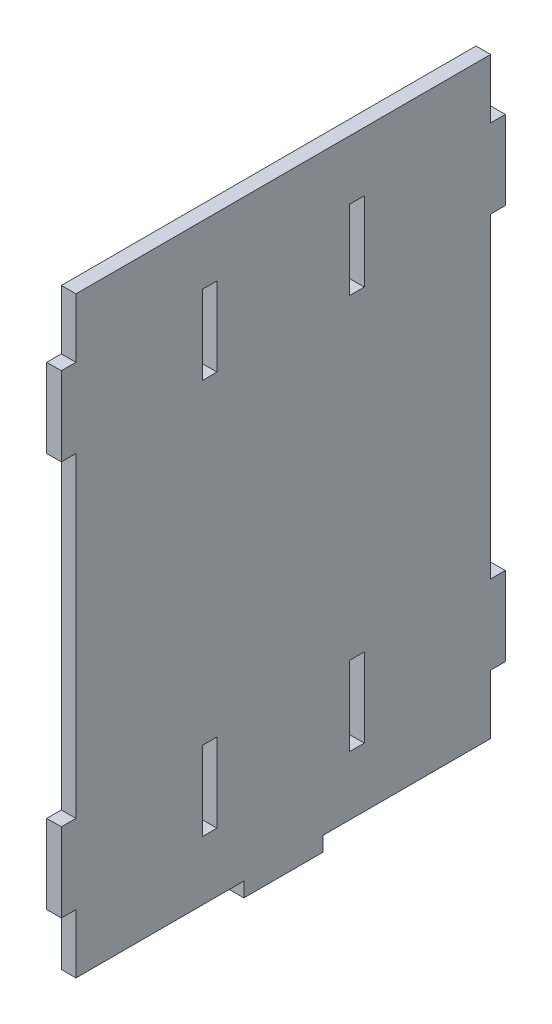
ISO-10303-21;
HEADER;
FILE_DESCRIPTION(('STEP AP214'),'2;1');
FILE_NAME('part.step','',(''),(''),'','','');
FILE_SCHEMA(('AUTOMOTIVE_DESIGN { 1 0 10303 214 1 1 1 1 }'));
ENDSEC;
DATA;
#1=APPLICATION_CONTEXT('core data for automotive mechanical design processes');
#2=APPLICATION_PROTOCOL_DEFINITION('international standard','automotive_design',2000,#1);
#3=PRODUCT_CONTEXT('',#1,'mechanical');
#4=PRODUCT('Part','Part','',(#3));
#5=PRODUCT_RELATED_PRODUCT_CATEGORY('part','',(#4));
#6=PRODUCT_DEFINITION_FORMATION('','',#4);
#7=PRODUCT_DEFINITION_CONTEXT('part definition',#1,'design');
#8=PRODUCT_DEFINITION('design','',#6,#7);
#9=PRODUCT_DEFINITION_SHAPE('','',#8);
#10=(LENGTH_UNIT() NAMED_UNIT(*) SI_UNIT(.MILLI.,.METRE.));
#11=(NAMED_UNIT(*) PLANE_ANGLE_UNIT() SI_UNIT($,.RADIAN.));
#12=(NAMED_UNIT(*) SI_UNIT($,.STERADIAN.) SOLID_ANGLE_UNIT());
#13=UNCERTAINTY_MEASURE_WITH_UNIT(LENGTH_MEASURE(1.E-05),#10,'distance_accuracy_value','');
#14=(GEOMETRIC_REPRESENTATION_CONTEXT(3) GLOBAL_UNCERTAINTY_ASSIGNED_CONTEXT((#13)) GLOBAL_UNIT_ASSIGNED_CONTEXT((#10,
#11,#12)) REPRESENTATION_CONTEXT('',''));
#15=CARTESIAN_POINT('',(0.,0.,0.));
#16=DIRECTION('',(0.,0.,1.));
#17=DIRECTION('',(1.,0.,0.));
#18=AXIS2_PLACEMENT_3D('',#15,#16,#17);
#19=CARTESIAN_POINT('',(3.7,0.,52.5));
#20=DIRECTION('',(-1.,0.,0.));
#21=DIRECTION('',(0.,0.,1.));
#22=AXIS2_PLACEMENT_3D('',#19,#20,#21);
#23=PLANE('',#22);
#24=DIRECTION('',(0.,-1.,0.));
#25=VECTOR('',#24,1.);
#26=CARTESIAN_POINT('',(3.7,35.,20.5));
#27=LINE('',#26,#25);
#28=CARTESIAN_POINT('',(3.7,35.,20.5));
#29=VERTEX_POINT('',#28);
#30=CARTESIAN_POINT('',(3.7,15.,20.5));
#31=VERTEX_POINT('',#30);
#32=EDGE_CURVE('E425',#29,#31,#27,.T.);
#33=ORIENTED_EDGE('',*,*,#32,.F.);
#34=DIRECTION('',(0.,0.,1.));
#35=VECTOR('',#34,1.);
#36=CARTESIAN_POINT('',(3.7,35.,20.5));
#37=LINE('',#36,#35);
#38=CARTESIAN_POINT('',(3.7,35.,16.8));
#39=VERTEX_POINT('',#38);
#40=EDGE_CURVE('E436',#39,#29,#37,.T.);
#41=ORIENTED_EDGE('',*,*,#40,.F.);
#42=DIRECTION('',(0.,1.,0.));
#43=VECTOR('',#42,1.);
#44=CARTESIAN_POINT('',(3.7,35.,16.8));
#45=LINE('',#44,#43);
#46=CARTESIAN_POINT('',(3.7,15.,16.8));
#47=VERTEX_POINT('',#46);
#48=EDGE_CURVE('E432',#47,#39,#45,.T.);
#49=ORIENTED_EDGE('',*,*,#48,.F.);
#50=DIRECTION('',(0.,0.,-1.));
#51=VECTOR('',#50,1.);
#52=CARTESIAN_POINT('',(3.7,15.,20.5));
#53=LINE('',#52,#51);
#54=EDGE_CURVE('E428',#31,#47,#53,.T.);
#55=ORIENTED_EDGE('',*,*,#54,.F.);
#56=EDGE_LOOP('',(#33,#41,#49,#55));
#57=FACE_BOUND('',#56,.T.);
#58=DIRECTION('',(0.,-1.,0.));
#59=VECTOR('',#58,1.);
#60=CARTESIAN_POINT('',(3.7,135.,20.5));
#61=LINE('',#60,#59);
#62=CARTESIAN_POINT('',(3.7,135.,20.5));
#63=VERTEX_POINT('',#62);
#64=CARTESIAN_POINT('',(3.7,115.,20.5));
#65=VERTEX_POINT('',#64);
#66=EDGE_CURVE('E510',#63,#65,#61,.T.);
#67=ORIENTED_EDGE('',*,*,#66,.F.);
#68=DIRECTION('',(0.,0.,1.));
#69=VECTOR('',#68,1.);
#70=CARTESIAN_POINT('',(3.7,135.,20.5));
#71=LINE('',#70,#69);
#72=CARTESIAN_POINT('',(3.7,135.,16.8));
#73=VERTEX_POINT('',#72);
#74=EDGE_CURVE('E521',#73,#63,#71,.T.);
#75=ORIENTED_EDGE('',*,*,#74,.F.);
#76=DIRECTION('',(0.,1.,0.));
#77=VECTOR('',#76,1.);
#78=CARTESIAN_POINT('',(3.7,135.,16.8));
#79=LINE('',#78,#77);
#80=CARTESIAN_POINT('',(3.7,115.,16.8));
#81=VERTEX_POINT('',#80);
#82=EDGE_CURVE('E517',#81,#73,#79,.T.);
#83=ORIENTED_EDGE('',*,*,#82,.F.);
#84=DIRECTION('',(0.,0.,-1.));
#85=VECTOR('',#84,1.);
#86=CARTESIAN_POINT('',(3.7,115.,20.5));
#87=LINE('',#86,#85);
#88=EDGE_CURVE('E513',#65,#81,#87,.T.);
#89=ORIENTED_EDGE('',*,*,#88,.F.);
#90=EDGE_LOOP('',(#67,#75,#83,#89));
#91=FACE_BOUND('',#90,.T.);
#92=DIRECTION('',(0.,0.,-1.));
#93=VECTOR('',#92,1.);
#94=CARTESIAN_POINT('',(3.7,0.,10.));
#95=LINE('',#94,#93);
#96=CARTESIAN_POINT('',(3.7,0.,52.5));
#97=VERTEX_POINT('',#96);
#98=CARTESIAN_POINT('',(3.7,0.,10.));
#99=VERTEX_POINT('',#98);
#100=EDGE_CURVE('E553',#97,#99,#95,.T.);
#101=ORIENTED_EDGE('',*,*,#100,.T.);
#102=DIRECTION('',(0.,-1.,0.));
#103=VECTOR('',#102,1.);
#104=CARTESIAN_POINT('',(3.7,0.,10.));
#105=LINE('',#104,#103);
#106=CARTESIAN_POINT('',(3.7,-3.7,10.));
#107=VERTEX_POINT('',#106);
#108=EDGE_CURVE('E557',#99,#107,#105,.T.);
#109=ORIENTED_EDGE('',*,*,#108,.T.);
#110=DIRECTION('',(0.,0.,-1.));
#111=VECTOR('',#110,1.);
#112=CARTESIAN_POINT('',(3.7,-3.7,10.));
#113=LINE('',#112,#111);
#114=CARTESIAN_POINT('',(3.7,-3.7,-10.));
#115=VERTEX_POINT('',#114);
#116=EDGE_CURVE('E561',#107,#115,#113,.T.);
#117=ORIENTED_EDGE('',*,*,#116,.T.);
#118=DIRECTION('',(0.,1.,0.));
#119=VECTOR('',#118,1.);
#120=CARTESIAN_POINT('',(3.7,0.,-10.));
#121=LINE('',#120,#119);
#122=CARTESIAN_POINT('',(3.7,0.,-10.));
#123=VERTEX_POINT('',#122);
#124=EDGE_CURVE('E564',#115,#123,#121,.T.);
#125=ORIENTED_EDGE('',*,*,#124,.T.);
#126=DIRECTION('',(0.,0.,-1.));
#127=VECTOR('',#126,1.);
#128=CARTESIAN_POINT('',(3.7,0.,-10.));
#129=LINE('',#128,#127);
#130=CARTESIAN_POINT('',(3.7,0.,-52.5));
#131=VERTEX_POINT('',#130);
#132=EDGE_CURVE('E567',#123,#131,#129,.T.);
#133=ORIENTED_EDGE('',*,*,#132,.T.);
#134=DIRECTION('',(0.,1.,0.));
#135=VECTOR('',#134,1.);
#136=CARTESIAN_POINT('',(3.7,0.,-52.5));
#137=LINE('',#136,#135);
#138=CARTESIAN_POINT('',(3.7,15.,-52.5));
#139=VERTEX_POINT('',#138);
#140=EDGE_CURVE('E570',#131,#139,#137,.T.);
#141=ORIENTED_EDGE('',*,*,#140,.T.);
#142=DIRECTION('',(0.,0.,-1.));
#143=VECTOR('',#142,1.);
#144=CARTESIAN_POINT('',(3.7,15.,-52.5));
#145=LINE('',#144,#143);
#146=CARTESIAN_POINT('',(3.7,15.,-56.2));
#147=VERTEX_POINT('',#146);
#148=EDGE_CURVE('E573',#139,#147,#145,.T.);
#149=ORIENTED_EDGE('',*,*,#148,.T.);
#150=DIRECTION('',(0.,1.,0.));
#151=VECTOR('',#150,1.);
#152=CARTESIAN_POINT('',(3.7,35.,-56.2));
#153=LINE('',#152,#151);
#154=CARTESIAN_POINT('',(3.7,35.,-56.2));
#155=VERTEX_POINT('',#154);
#156=EDGE_CURVE('E576',#147,#155,#153,.T.);
#157=ORIENTED_EDGE('',*,*,#156,.T.);
#158=DIRECTION('',(0.,0.,1.));
#159=VECTOR('',#158,1.);
#160=CARTESIAN_POINT('',(3.7,35.,-52.5));
#161=LINE('',#160,#159);
#162=CARTESIAN_POINT('',(3.7,35.,-52.5));
#163=VERTEX_POINT('',#162);
#164=EDGE_CURVE('E579',#155,#163,#161,.T.);
#165=ORIENTED_EDGE('',*,*,#164,.T.);
#166=DIRECTION('',(0.,1.,0.));
#167=VECTOR('',#166,1.);
#168=CARTESIAN_POINT('',(3.7,35.,-52.5));
#169=LINE('',#168,#167);
#170=CARTESIAN_POINT('',(3.7,115.,-52.5));
#171=VERTEX_POINT('',#170);
#172=EDGE_CURVE('E582',#163,#171,#169,.T.);
#173=ORIENTED_EDGE('',*,*,#172,.T.);
#174=DIRECTION('',(0.,0.,-1.));
#175=VECTOR('',#174,1.);
#176=CARTESIAN_POINT('',(3.7,115.,-52.5));
#177=LINE('',#176,#175);
#178=CARTESIAN_POINT('',(3.7,115.,-56.2));
#179=VERTEX_POINT('',#178);
#180=EDGE_CURVE('E585',#171,#179,#177,.T.);
#181=ORIENTED_EDGE('',*,*,#180,.T.);
#182=DIRECTION('',(0.,1.,0.));
#183=VECTOR('',#182,1.);
#184=CARTESIAN_POINT('',(3.7,135.,-56.2));
#185=LINE('',#184,#183);
#186=CARTESIAN_POINT('',(3.7,135.,-56.2));
#187=VERTEX_POINT('',#186);
#188=EDGE_CURVE('E588',#179,#187,#185,.T.);
#189=ORIENTED_EDGE('',*,*,#188,.T.);
#190=DIRECTION('',(0.,0.,1.));
#191=VECTOR('',#190,1.);
#192=CARTESIAN_POINT('',(3.7,135.,-52.5));
#193=LINE('',#192,#191);
#194=CARTESIAN_POINT('',(3.7,135.,-52.5));
#195=VERTEX_POINT('',#194);
#196=EDGE_CURVE('E591',#187,#195,#193,.T.);
#197=ORIENTED_EDGE('',*,*,#196,.T.);
#198=DIRECTION('',(0.,1.,0.));
#199=VECTOR('',#198,1.);
#200=CARTESIAN_POINT('',(3.7,135.,-52.5));
#201=LINE('',#200,#199);
#202=CARTESIAN_POINT('',(3.7,150.,-52.5));
#203=VERTEX_POINT('',#202);
#204=EDGE_CURVE('E594',#195,#203,#201,.T.);
#205=ORIENTED_EDGE('',*,*,#204,.T.);
#206=DIRECTION('',(0.,0.,1.));
#207=VECTOR('',#206,1.);
#208=CARTESIAN_POINT('',(3.7,150.,52.5));
#209=LINE('',#208,#207);
#210=CARTESIAN_POINT('',(3.7,150.,52.5));
#211=VERTEX_POINT('',#210);
#212=EDGE_CURVE('E597',#203,#211,#209,.T.);
#213=ORIENTED_EDGE('',*,*,#212,.T.);
#214=DIRECTION('',(0.,-1.,0.));
#215=VECTOR('',#214,1.);
#216=CARTESIAN_POINT('',(3.7,135.,52.5));
#217=LINE('',#216,#215);
#218=CARTESIAN_POINT('',(3.7,135.,52.5));
#219=VERTEX_POINT('',#218);
#220=EDGE_CURVE('E600',#211,#219,#217,.T.);
#221=ORIENTED_EDGE('',*,*,#220,.T.);
#222=DIRECTION('',(0.,0.,1.));
#223=VECTOR('',#222,1.);
#224=CARTESIAN_POINT('',(3.7,135.,56.2));
#225=LINE('',#224,#223);
#226=CARTESIAN_POINT('',(3.7,135.,56.2));
#227=VERTEX_POINT('',#226);
#228=EDGE_CURVE('E603',#219,#227,#225,.T.);
#229=ORIENTED_EDGE('',*,*,#228,.T.);
#230=DIRECTION('',(0.,-1.,0.));
#231=VECTOR('',#230,1.);
#232=CARTESIAN_POINT('',(3.7,135.,56.2));
#233=LINE('',#232,#231);
#234=CARTESIAN_POINT('',(3.7,115.,56.2));
#235=VERTEX_POINT('',#234);
#236=EDGE_CURVE('E606',#227,#235,#233,.T.);
#237=ORIENTED_EDGE('',*,*,#236,.T.);
#238=DIRECTION('',(0.,0.,-1.));
#239=VECTOR('',#238,1.);
#240=CARTESIAN_POINT('',(3.7,115.,56.2));
#241=LINE('',#240,#239);
#242=CARTESIAN_POINT('',(3.7,115.,52.5));
#243=VERTEX_POINT('',#242);
#244=EDGE_CURVE('E609',#235,#243,#241,.T.);
#245=ORIENTED_EDGE('',*,*,#244,.T.);
#246=DIRECTION('',(0.,-1.,0.));
#247=VECTOR('',#246,1.);
#248=CARTESIAN_POINT('',(3.7,35.,52.5));
#249=LINE('',#248,#247);
#250=CARTESIAN_POINT('',(3.7,35.,52.5));
#251=VERTEX_POINT('',#250);
#252=EDGE_CURVE('E612',#243,#251,#249,.T.);
#253=ORIENTED_EDGE('',*,*,#252,.T.);
#254=DIRECTION('',(0.,0.,1.));
#255=VECTOR('',#254,1.);
#256=CARTESIAN_POINT('',(3.7,35.,56.2));
#257=LINE('',#256,#255);
#258=CARTESIAN_POINT('',(3.7,35.,56.2));
#259=VERTEX_POINT('',#258);
#260=EDGE_CURVE('E615',#251,#259,#257,.T.);
#261=ORIENTED_EDGE('',*,*,#260,.T.);
#262=DIRECTION('',(0.,-1.,0.));
#263=VECTOR('',#262,1.);
#264=CARTESIAN_POINT('',(3.7,35.,56.2));
#265=LINE('',#264,#263);
#266=CARTESIAN_POINT('',(3.7,15.,56.2));
#267=VERTEX_POINT('',#266);
#268=EDGE_CURVE('E618',#259,#267,#265,.T.);
#269=ORIENTED_EDGE('',*,*,#268,.T.);
#270=DIRECTION('',(0.,0.,-1.));
#271=VECTOR('',#270,1.);
#272=CARTESIAN_POINT('',(3.7,15.,56.2));
#273=LINE('',#272,#271);
#274=CARTESIAN_POINT('',(3.7,15.,52.5));
#275=VERTEX_POINT('',#274);
#276=EDGE_CURVE('E621',#267,#275,#273,.T.);
#277=ORIENTED_EDGE('',*,*,#276,.T.);
#278=DIRECTION('',(0.,-1.,0.));
#279=VECTOR('',#278,1.);
#280=CARTESIAN_POINT('',(3.7,0.,52.5));
#281=LINE('',#280,#279);
#282=EDGE_CURVE('E624',#275,#97,#281,.T.);
#283=ORIENTED_EDGE('',*,*,#282,.T.);
#284=EDGE_LOOP('',(#101,#109,#117,#125,#133,#141,#149,#157,#165,#173,#181,#189,#197,#205,#213,
#221,#229,#237,#245,#253,#261,#269,#277,#283));
#285=FACE_BOUND('',#284,.T.);
#286=DIRECTION('',(0.,1.,0.));
#287=VECTOR('',#286,1.);
#288=CARTESIAN_POINT('',(3.7,135.,-20.5));
#289=LINE('',#288,#287);
#290=CARTESIAN_POINT('',(3.7,115.,-20.5));
#291=VERTEX_POINT('',#290);
#292=CARTESIAN_POINT('',(3.7,135.,-20.5));
#293=VERTEX_POINT('',#292);
#294=EDGE_CURVE('E468',#291,#293,#289,.T.);
#295=ORIENTED_EDGE('',*,*,#294,.F.);
#296=DIRECTION('',(0.,0.,-1.));
#297=VECTOR('',#296,1.);
#298=CARTESIAN_POINT('',(3.7,115.,-20.5));
#299=LINE('',#298,#297);
#300=CARTESIAN_POINT('',(3.7,115.,-16.8));
#301=VERTEX_POINT('',#300);
#302=EDGE_CURVE('E478',#301,#291,#299,.T.);
#303=ORIENTED_EDGE('',*,*,#302,.F.);
#304=DIRECTION('',(0.,-1.,0.));
#305=VECTOR('',#304,1.);
#306=CARTESIAN_POINT('',(3.7,135.,-16.8));
#307=LINE('',#306,#305);
#308=CARTESIAN_POINT('',(3.7,135.,-16.8));
#309=VERTEX_POINT('',#308);
#310=EDGE_CURVE('E474',#309,#301,#307,.T.);
#311=ORIENTED_EDGE('',*,*,#310,.F.);
#312=DIRECTION('',(0.,0.,1.));
#313=VECTOR('',#312,1.);
#314=CARTESIAN_POINT('',(3.7,135.,-20.5));
#315=LINE('',#314,#313);
#316=EDGE_CURVE('E470',#293,#309,#315,.T.);
#317=ORIENTED_EDGE('',*,*,#316,.F.);
#318=EDGE_LOOP('',(#295,#303,#311,#317));
#319=FACE_BOUND('',#318,.T.);
#320=DIRECTION('',(0.,-1.,0.));
#321=VECTOR('',#320,1.);
#322=CARTESIAN_POINT('',(3.7,35.,-16.8));
#323=LINE('',#322,#321);
#324=CARTESIAN_POINT('',(3.7,35.,-16.8));
#325=VERTEX_POINT('',#324);
#326=CARTESIAN_POINT('',(3.7,15.,-16.8));
#327=VERTEX_POINT('',#326);
#328=EDGE_CURVE('E376',#325,#327,#323,.T.);
#329=ORIENTED_EDGE('',*,*,#328,.F.);
#330=DIRECTION('',(0.,0.,1.));
#331=VECTOR('',#330,1.);
#332=CARTESIAN_POINT('',(3.7,35.,-16.8));
#333=LINE('',#332,#331);
#334=CARTESIAN_POINT('',(3.7,35.,-20.5));
#335=VERTEX_POINT('',#334);
#336=EDGE_CURVE('E403',#335,#325,#333,.T.);
#337=ORIENTED_EDGE('',*,*,#336,.F.);
#338=DIRECTION('',(0.,1.,0.));
#339=VECTOR('',#338,1.);
#340=CARTESIAN_POINT('',(3.7,35.,-20.5));
#341=LINE('',#340,#339);
#342=CARTESIAN_POINT('',(3.7,15.,-20.5));
#343=VERTEX_POINT('',#342);
#344=EDGE_CURVE('E398',#343,#335,#341,.T.);
#345=ORIENTED_EDGE('',*,*,#344,.F.);
#346=DIRECTION('',(0.,0.,-1.));
#347=VECTOR('',#346,1.);
#348=CARTESIAN_POINT('',(3.7,15.,-16.8));
#349=LINE('',#348,#347);
#350=EDGE_CURVE('E385',#327,#343,#349,.T.);
#351=ORIENTED_EDGE('',*,*,#350,.F.);
#352=EDGE_LOOP('',(#329,#337,#345,#351));
#353=FACE_BOUND('',#352,.T.);
#354=ADVANCED_FACE('F39',(#57,#91,#285,#319,#353),#23,.F.);
#355=CARTESIAN_POINT('',(0.,0.,52.5));
#356=DIRECTION('',(-1.,0.,0.));
#357=DIRECTION('',(0.,0.,1.));
#358=AXIS2_PLACEMENT_3D('',#355,#356,#357);
#359=PLANE('',#358);
#360=DIRECTION('',(0.,0.,1.));
#361=VECTOR('',#360,1.);
#362=CARTESIAN_POINT('',(0.,35.,20.5));
#363=LINE('',#362,#361);
#364=CARTESIAN_POINT('',(0.,35.,16.8));
#365=VERTEX_POINT('',#364);
#366=CARTESIAN_POINT('',(0.,35.,20.5));
#367=VERTEX_POINT('',#366);
#368=EDGE_CURVE('E429',#365,#367,#363,.T.);
#369=ORIENTED_EDGE('',*,*,#368,.T.);
#370=DIRECTION('',(0.,-1.,0.));
#371=VECTOR('',#370,1.);
#372=CARTESIAN_POINT('',(0.,35.,20.5));
#373=LINE('',#372,#371);
#374=CARTESIAN_POINT('',(0.,15.,20.5));
#375=VERTEX_POINT('',#374);
#376=EDGE_CURVE('E394',#367,#375,#373,.T.);
#377=ORIENTED_EDGE('',*,*,#376,.T.);
#378=DIRECTION('',(0.,0.,-1.));
#379=VECTOR('',#378,1.);
#380=CARTESIAN_POINT('',(0.,15.,20.5));
#381=LINE('',#380,#379);
#382=CARTESIAN_POINT('',(0.,15.,16.8));
#383=VERTEX_POINT('',#382);
#384=EDGE_CURVE('E443',#375,#383,#381,.T.);
#385=ORIENTED_EDGE('',*,*,#384,.T.);
#386=DIRECTION('',(0.,1.,0.));
#387=VECTOR('',#386,1.);
#388=CARTESIAN_POINT('',(0.,35.,16.8));
#389=LINE('',#388,#387);
#390=EDGE_CURVE('E447',#383,#365,#389,.T.);
#391=ORIENTED_EDGE('',*,*,#390,.T.);
#392=EDGE_LOOP('',(#369,#377,#385,#391));
#393=FACE_BOUND('',#392,.T.);
#394=DIRECTION('',(0.,0.,1.));
#395=VECTOR('',#394,1.);
#396=CARTESIAN_POINT('',(0.,135.,20.5));
#397=LINE('',#396,#395);
#398=CARTESIAN_POINT('',(0.,135.,16.8));
#399=VERTEX_POINT('',#398);
#400=CARTESIAN_POINT('',(0.,135.,20.5));
#401=VERTEX_POINT('',#400);
#402=EDGE_CURVE('E514',#399,#401,#397,.T.);
#403=ORIENTED_EDGE('',*,*,#402,.T.);
#404=DIRECTION('',(0.,-1.,0.));
#405=VECTOR('',#404,1.);
#406=CARTESIAN_POINT('',(0.,135.,20.5));
#407=LINE('',#406,#405);
#408=CARTESIAN_POINT('',(0.,115.,20.5));
#409=VERTEX_POINT('',#408);
#410=EDGE_CURVE('E509',#401,#409,#407,.T.);
#411=ORIENTED_EDGE('',*,*,#410,.T.);
#412=DIRECTION('',(0.,0.,-1.));
#413=VECTOR('',#412,1.);
#414=CARTESIAN_POINT('',(0.,115.,20.5));
#415=LINE('',#414,#413);
#416=CARTESIAN_POINT('',(0.,115.,16.8));
#417=VERTEX_POINT('',#416);
#418=EDGE_CURVE('E528',#409,#417,#415,.T.);
#419=ORIENTED_EDGE('',*,*,#418,.T.);
#420=DIRECTION('',(0.,1.,0.));
#421=VECTOR('',#420,1.);
#422=CARTESIAN_POINT('',(0.,135.,16.8));
#423=LINE('',#422,#421);
#424=EDGE_CURVE('E532',#417,#399,#423,.T.);
#425=ORIENTED_EDGE('',*,*,#424,.T.);
#426=EDGE_LOOP('',(#403,#411,#419,#425));
#427=FACE_BOUND('',#426,.T.);
#428=DIRECTION('',(0.,0.,-1.));
#429=VECTOR('',#428,1.);
#430=CARTESIAN_POINT('',(0.,0.,10.));
#431=LINE('',#430,#429);
#432=CARTESIAN_POINT('',(0.,0.,52.5));
#433=VERTEX_POINT('',#432);
#434=CARTESIAN_POINT('',(0.,0.,10.));
#435=VERTEX_POINT('',#434);
#436=EDGE_CURVE('E552',#433,#435,#431,.T.);
#437=ORIENTED_EDGE('',*,*,#436,.F.);
#438=DIRECTION('',(0.,-1.,0.));
#439=VECTOR('',#438,1.);
#440=CARTESIAN_POINT('',(0.,0.,52.5));
#441=LINE('',#440,#439);
#442=CARTESIAN_POINT('',(0.,15.,52.5));
#443=VERTEX_POINT('',#442);
#444=EDGE_CURVE('E558',#443,#433,#441,.T.);
#445=ORIENTED_EDGE('',*,*,#444,.F.);
#446=DIRECTION('',(0.,0.,-1.));
#447=VECTOR('',#446,1.);
#448=CARTESIAN_POINT('',(0.,15.,56.2));
#449=LINE('',#448,#447);
#450=CARTESIAN_POINT('',(0.,15.,56.2));
#451=VERTEX_POINT('',#450);
#452=EDGE_CURVE('E694',#451,#443,#449,.T.);
#453=ORIENTED_EDGE('',*,*,#452,.F.);
#454=DIRECTION('',(0.,-1.,0.));
#455=VECTOR('',#454,1.);
#456=CARTESIAN_POINT('',(0.,35.,56.2));
#457=LINE('',#456,#455);
#458=CARTESIAN_POINT('',(0.,35.,56.2));
#459=VERTEX_POINT('',#458);
#460=EDGE_CURVE('E691',#459,#451,#457,.T.);
#461=ORIENTED_EDGE('',*,*,#460,.F.);
#462=DIRECTION('',(0.,0.,1.));
#463=VECTOR('',#462,1.);
#464=CARTESIAN_POINT('',(0.,35.,56.2));
#465=LINE('',#464,#463);
#466=CARTESIAN_POINT('',(0.,35.,52.5));
#467=VERTEX_POINT('',#466);
#468=EDGE_CURVE('E688',#467,#459,#465,.T.);
#469=ORIENTED_EDGE('',*,*,#468,.F.);
#470=DIRECTION('',(0.,-1.,0.));
#471=VECTOR('',#470,1.);
#472=CARTESIAN_POINT('',(0.,35.,52.5));
#473=LINE('',#472,#471);
#474=CARTESIAN_POINT('',(0.,115.,52.5));
#475=VERTEX_POINT('',#474);
#476=EDGE_CURVE('E685',#475,#467,#473,.T.);
#477=ORIENTED_EDGE('',*,*,#476,.F.);
#478=DIRECTION('',(0.,0.,-1.));
#479=VECTOR('',#478,1.);
#480=CARTESIAN_POINT('',(0.,115.,56.2));
#481=LINE('',#480,#479);
#482=CARTESIAN_POINT('',(0.,115.,56.2));
#483=VERTEX_POINT('',#482);
#484=EDGE_CURVE('E682',#483,#475,#481,.T.);
#485=ORIENTED_EDGE('',*,*,#484,.F.);
#486=DIRECTION('',(0.,-1.,0.));
#487=VECTOR('',#486,1.);
#488=CARTESIAN_POINT('',(0.,135.,56.2));
#489=LINE('',#488,#487);
#490=CARTESIAN_POINT('',(0.,135.,56.2));
#491=VERTEX_POINT('',#490);
#492=EDGE_CURVE('E679',#491,#483,#489,.T.);
#493=ORIENTED_EDGE('',*,*,#492,.F.);
#494=DIRECTION('',(0.,0.,1.));
#495=VECTOR('',#494,1.);
#496=CARTESIAN_POINT('',(0.,135.,56.2));
#497=LINE('',#496,#495);
#498=CARTESIAN_POINT('',(0.,135.,52.5));
#499=VERTEX_POINT('',#498);
#500=EDGE_CURVE('E676',#499,#491,#497,.T.);
#501=ORIENTED_EDGE('',*,*,#500,.F.);
#502=DIRECTION('',(0.,-1.,0.));
#503=VECTOR('',#502,1.);
#504=CARTESIAN_POINT('',(0.,135.,52.5));
#505=LINE('',#504,#503);
#506=CARTESIAN_POINT('',(0.,150.,52.5));
#507=VERTEX_POINT('',#506);
#508=EDGE_CURVE('E673',#507,#499,#505,.T.);
#509=ORIENTED_EDGE('',*,*,#508,.F.);
#510=DIRECTION('',(0.,0.,1.));
#511=VECTOR('',#510,1.);
#512=CARTESIAN_POINT('',(0.,150.,52.5));
#513=LINE('',#512,#511);
#514=CARTESIAN_POINT('',(0.,150.,-52.5));
#515=VERTEX_POINT('',#514);
#516=EDGE_CURVE('E670',#515,#507,#513,.T.);
#517=ORIENTED_EDGE('',*,*,#516,.F.);
#518=DIRECTION('',(0.,1.,0.));
#519=VECTOR('',#518,1.);
#520=CARTESIAN_POINT('',(0.,135.,-52.5));
#521=LINE('',#520,#519);
#522=CARTESIAN_POINT('',(0.,135.,-52.5));
#523=VERTEX_POINT('',#522);
#524=EDGE_CURVE('E667',#523,#515,#521,.T.);
#525=ORIENTED_EDGE('',*,*,#524,.F.);
#526=DIRECTION('',(0.,0.,1.));
#527=VECTOR('',#526,1.);
#528=CARTESIAN_POINT('',(0.,135.,-52.5));
#529=LINE('',#528,#527);
#530=CARTESIAN_POINT('',(0.,135.,-56.2));
#531=VERTEX_POINT('',#530);
#532=EDGE_CURVE('E664',#531,#523,#529,.T.);
#533=ORIENTED_EDGE('',*,*,#532,.F.);
#534=DIRECTION('',(0.,1.,0.));
#535=VECTOR('',#534,1.);
#536=CARTESIAN_POINT('',(0.,135.,-56.2));
#537=LINE('',#536,#535);
#538=CARTESIAN_POINT('',(0.,115.,-56.2));
#539=VERTEX_POINT('',#538);
#540=EDGE_CURVE('E661',#539,#531,#537,.T.);
#541=ORIENTED_EDGE('',*,*,#540,.F.);
#542=DIRECTION('',(0.,0.,-1.));
#543=VECTOR('',#542,1.);
#544=CARTESIAN_POINT('',(0.,115.,-52.5));
#545=LINE('',#544,#543);
#546=CARTESIAN_POINT('',(0.,115.,-52.5));
#547=VERTEX_POINT('',#546);
#548=EDGE_CURVE('E658',#547,#539,#545,.T.);
#549=ORIENTED_EDGE('',*,*,#548,.F.);
#550=DIRECTION('',(0.,1.,0.));
#551=VECTOR('',#550,1.);
#552=CARTESIAN_POINT('',(0.,35.,-52.5));
#553=LINE('',#552,#551);
#554=CARTESIAN_POINT('',(0.,35.,-52.5));
#555=VERTEX_POINT('',#554);
#556=EDGE_CURVE('E655',#555,#547,#553,.T.);
#557=ORIENTED_EDGE('',*,*,#556,.F.);
#558=DIRECTION('',(0.,0.,1.));
#559=VECTOR('',#558,1.);
#560=CARTESIAN_POINT('',(0.,35.,-52.5));
#561=LINE('',#560,#559);
#562=CARTESIAN_POINT('',(0.,35.,-56.2));
#563=VERTEX_POINT('',#562);
#564=EDGE_CURVE('E652',#563,#555,#561,.T.);
#565=ORIENTED_EDGE('',*,*,#564,.F.);
#566=DIRECTION('',(0.,1.,0.));
#567=VECTOR('',#566,1.);
#568=CARTESIAN_POINT('',(0.,35.,-56.2));
#569=LINE('',#568,#567);
#570=CARTESIAN_POINT('',(0.,15.,-56.2));
#571=VERTEX_POINT('',#570);
#572=EDGE_CURVE('E649',#571,#563,#569,.T.);
#573=ORIENTED_EDGE('',*,*,#572,.F.);
#574=DIRECTION('',(0.,0.,-1.));
#575=VECTOR('',#574,1.);
#576=CARTESIAN_POINT('',(0.,15.,-52.5));
#577=LINE('',#576,#575);
#578=CARTESIAN_POINT('',(0.,15.,-52.5));
#579=VERTEX_POINT('',#578);
#580=EDGE_CURVE('E646',#579,#571,#577,.T.);
#581=ORIENTED_EDGE('',*,*,#580,.F.);
#582=DIRECTION('',(0.,1.,0.));
#583=VECTOR('',#582,1.);
#584=CARTESIAN_POINT('',(0.,0.,-52.5));
#585=LINE('',#584,#583);
#586=CARTESIAN_POINT('',(0.,0.,-52.5));
#587=VERTEX_POINT('',#586);
#588=EDGE_CURVE('E643',#587,#579,#585,.T.);
#589=ORIENTED_EDGE('',*,*,#588,.F.);
#590=DIRECTION('',(0.,0.,-1.));
#591=VECTOR('',#590,1.);
#592=CARTESIAN_POINT('',(0.,0.,-10.));
#593=LINE('',#592,#591);
#594=CARTESIAN_POINT('',(0.,0.,-10.));
#595=VERTEX_POINT('',#594);
#596=EDGE_CURVE('E640',#595,#587,#593,.T.);
#597=ORIENTED_EDGE('',*,*,#596,.F.);
#598=DIRECTION('',(0.,1.,0.));
#599=VECTOR('',#598,1.);
#600=CARTESIAN_POINT('',(0.,0.,-10.));
#601=LINE('',#600,#599);
#602=CARTESIAN_POINT('',(0.,-3.7,-10.));
#603=VERTEX_POINT('',#602);
#604=EDGE_CURVE('E637',#603,#595,#601,.T.);
#605=ORIENTED_EDGE('',*,*,#604,.F.);
#606=DIRECTION('',(0.,0.,-1.));
#607=VECTOR('',#606,1.);
#608=CARTESIAN_POINT('',(0.,-3.7,10.));
#609=LINE('',#608,#607);
#610=CARTESIAN_POINT('',(0.,-3.7,10.));
#611=VERTEX_POINT('',#610);
#612=EDGE_CURVE('E634',#611,#603,#609,.T.);
#613=ORIENTED_EDGE('',*,*,#612,.F.);
#614=DIRECTION('',(0.,-1.,0.));
#615=VECTOR('',#614,1.);
#616=CARTESIAN_POINT('',(0.,0.,10.));
#617=LINE('',#616,#615);
#618=EDGE_CURVE('E631',#435,#611,#617,.T.);
#619=ORIENTED_EDGE('',*,*,#618,.F.);
#620=EDGE_LOOP('',(#437,#445,#453,#461,#469,#477,#485,#493,#501,#509,#517,#525,#533,#541,#549,
#557,#565,#573,#581,#589,#597,#605,#613,#619));
#621=FACE_BOUND('',#620,.T.);
#622=DIRECTION('',(0.,0.,-1.));
#623=VECTOR('',#622,1.);
#624=CARTESIAN_POINT('',(0.,115.,-20.5));
#625=LINE('',#624,#623);
#626=CARTESIAN_POINT('',(0.,115.,-16.8));
#627=VERTEX_POINT('',#626);
#628=CARTESIAN_POINT('',(0.,115.,-20.5));
#629=VERTEX_POINT('',#628);
#630=EDGE_CURVE('E471',#627,#629,#625,.T.);
#631=ORIENTED_EDGE('',*,*,#630,.T.);
#632=DIRECTION('',(0.,1.,0.));
#633=VECTOR('',#632,1.);
#634=CARTESIAN_POINT('',(0.,135.,-20.5));
#635=LINE('',#634,#633);
#636=CARTESIAN_POINT('',(0.,135.,-20.5));
#637=VERTEX_POINT('',#636);
#638=EDGE_CURVE('E467',#629,#637,#635,.T.);
#639=ORIENTED_EDGE('',*,*,#638,.T.);
#640=DIRECTION('',(0.,0.,1.));
#641=VECTOR('',#640,1.);
#642=CARTESIAN_POINT('',(0.,135.,-20.5));
#643=LINE('',#642,#641);
#644=CARTESIAN_POINT('',(0.,135.,-16.8));
#645=VERTEX_POINT('',#644);
#646=EDGE_CURVE('E485',#637,#645,#643,.T.);
#647=ORIENTED_EDGE('',*,*,#646,.T.);
#648=DIRECTION('',(0.,-1.,0.));
#649=VECTOR('',#648,1.);
#650=CARTESIAN_POINT('',(0.,135.,-16.8));
#651=LINE('',#650,#649);
#652=EDGE_CURVE('E489',#645,#627,#651,.T.);
#653=ORIENTED_EDGE('',*,*,#652,.T.);
#654=EDGE_LOOP('',(#631,#639,#647,#653));
#655=FACE_BOUND('',#654,.T.);
#656=DIRECTION('',(0.,0.,1.));
#657=VECTOR('',#656,1.);
#658=CARTESIAN_POINT('',(0.,35.,-16.8));
#659=LINE('',#658,#657);
#660=CARTESIAN_POINT('',(0.,35.,-20.5));
#661=VERTEX_POINT('',#660);
#662=CARTESIAN_POINT('',(0.,35.,-16.8));
#663=VERTEX_POINT('',#662);
#664=EDGE_CURVE('E386',#661,#663,#659,.T.);
#665=ORIENTED_EDGE('',*,*,#664,.T.);
#666=DIRECTION('',(0.,-1.,0.));
#667=VECTOR('',#666,1.);
#668=CARTESIAN_POINT('',(0.,35.,-16.8));
#669=LINE('',#668,#667);
#670=CARTESIAN_POINT('',(0.,15.,-16.8));
#671=VERTEX_POINT('',#670);
#672=EDGE_CURVE('E69',#663,#671,#669,.T.);
#673=ORIENTED_EDGE('',*,*,#672,.T.);
#674=DIRECTION('',(0.,0.,-1.));
#675=VECTOR('',#674,1.);
#676=CARTESIAN_POINT('',(0.,15.,-16.8));
#677=LINE('',#676,#675);
#678=CARTESIAN_POINT('',(0.,15.,-20.5));
#679=VERTEX_POINT('',#678);
#680=EDGE_CURVE('E392',#671,#679,#677,.T.);
#681=ORIENTED_EDGE('',*,*,#680,.T.);
#682=DIRECTION('',(0.,1.,0.));
#683=VECTOR('',#682,1.);
#684=CARTESIAN_POINT('',(0.,35.,-20.5));
#685=LINE('',#684,#683);
#686=EDGE_CURVE('E412',#679,#661,#685,.T.);
#687=ORIENTED_EDGE('',*,*,#686,.T.);
#688=EDGE_LOOP('',(#665,#673,#681,#687));
#689=FACE_BOUND('',#688,.T.);
#690=ADVANCED_FACE('F797',(#393,#427,#621,#655,#689),#359,.T.);
#691=CARTESIAN_POINT('',(3.7,0.,10.));
#692=DIRECTION('',(0.,1.,0.));
#693=DIRECTION('',(0.,0.,1.));
#694=AXIS2_PLACEMENT_3D('',#691,#692,#693);
#695=PLANE('',#694);
#696=ORIENTED_EDGE('',*,*,#436,.T.);
#697=DIRECTION('',(-1.,0.,0.));
#698=VECTOR('',#697,1.);
#699=CARTESIAN_POINT('',(3.7,0.,10.));
#700=LINE('',#699,#698);
#701=EDGE_CURVE('E11',#99,#435,#700,.T.);
#702=ORIENTED_EDGE('',*,*,#701,.F.);
#703=ORIENTED_EDGE('',*,*,#100,.F.);
#704=DIRECTION('',(-1.,0.,0.));
#705=VECTOR('',#704,1.);
#706=CARTESIAN_POINT('',(3.7,0.,52.5));
#707=LINE('',#706,#705);
#708=EDGE_CURVE('E627',#97,#433,#707,.T.);
#709=ORIENTED_EDGE('',*,*,#708,.T.);
#710=EDGE_LOOP('',(#696,#702,#703,#709));
#711=FACE_BOUND('',#710,.T.);
#712=ADVANCED_FACE('F41',(#711),#695,.F.);
#713=CARTESIAN_POINT('',(3.7,0.,10.));
#714=DIRECTION('',(0.,0.,-1.));
#715=DIRECTION('',(-1.,0.,0.));
#716=AXIS2_PLACEMENT_3D('',#713,#714,#715);
#717=PLANE('',#716);
#718=ORIENTED_EDGE('',*,*,#618,.T.);
#719=DIRECTION('',(-1.,0.,0.));
#720=VECTOR('',#719,1.);
#721=CARTESIAN_POINT('',(3.7,-3.7,10.));
#722=LINE('',#721,#720);
#723=EDGE_CURVE('E48',#107,#611,#722,.T.);
#724=ORIENTED_EDGE('',*,*,#723,.F.);
#725=ORIENTED_EDGE('',*,*,#108,.F.);
#726=ORIENTED_EDGE('',*,*,#701,.T.);
#727=EDGE_LOOP('',(#718,#724,#725,#726));
#728=FACE_BOUND('',#727,.T.);
#729=ADVANCED_FACE('F815',(#728),#717,.F.);
#730=CARTESIAN_POINT('',(3.7,-3.7,10.));
#731=DIRECTION('',(0.,1.,0.));
#732=DIRECTION('',(0.,0.,1.));
#733=AXIS2_PLACEMENT_3D('',#730,#731,#732);
#734=PLANE('',#733);
#735=ORIENTED_EDGE('',*,*,#612,.T.);
#736=DIRECTION('',(-1.,0.,0.));
#737=VECTOR('',#736,1.);
#738=CARTESIAN_POINT('',(3.7,-3.7,-10.));
#739=LINE('',#738,#737);
#740=EDGE_CURVE('E782',#115,#603,#739,.T.);
#741=ORIENTED_EDGE('',*,*,#740,.F.);
#742=ORIENTED_EDGE('',*,*,#116,.F.);
#743=ORIENTED_EDGE('',*,*,#723,.T.);
#744=EDGE_LOOP('',(#735,#741,#742,#743));
#745=FACE_BOUND('',#744,.T.);
#746=ADVANCED_FACE('F791',(#745),#734,.F.);
#747=CARTESIAN_POINT('',(3.7,0.,-10.));
#748=DIRECTION('',(0.,0.,1.));
#749=DIRECTION('',(1.,0.,0.));
#750=AXIS2_PLACEMENT_3D('',#747,#748,#749);
#751=PLANE('',#750);
#752=ORIENTED_EDGE('',*,*,#604,.T.);
#753=DIRECTION('',(-1.,0.,0.));
#754=VECTOR('',#753,1.);
#755=CARTESIAN_POINT('',(3.7,0.,-10.));
#756=LINE('',#755,#754);
#757=EDGE_CURVE('E778',#123,#595,#756,.T.);
#758=ORIENTED_EDGE('',*,*,#757,.F.);
#759=ORIENTED_EDGE('',*,*,#124,.F.);
#760=ORIENTED_EDGE('',*,*,#740,.T.);
#761=EDGE_LOOP('',(#752,#758,#759,#760));
#762=FACE_BOUND('',#761,.T.);
#763=ADVANCED_FACE('F803',(#762),#751,.F.);
#764=CARTESIAN_POINT('',(3.7,0.,-10.));
#765=DIRECTION('',(0.,1.,0.));
#766=DIRECTION('',(0.,0.,1.));
#767=AXIS2_PLACEMENT_3D('',#764,#765,#766);
#768=PLANE('',#767);
#769=ORIENTED_EDGE('',*,*,#596,.T.);
#770=DIRECTION('',(-1.,0.,0.));
#771=VECTOR('',#770,1.);
#772=CARTESIAN_POINT('',(3.7,0.,-52.5));
#773=LINE('',#772,#771);
#774=EDGE_CURVE('E774',#131,#587,#773,.T.);
#775=ORIENTED_EDGE('',*,*,#774,.F.);
#776=ORIENTED_EDGE('',*,*,#132,.F.);
#777=ORIENTED_EDGE('',*,*,#757,.T.);
#778=EDGE_LOOP('',(#769,#775,#776,#777));
#779=FACE_BOUND('',#778,.T.);
#780=ADVANCED_FACE('F807',(#779),#768,.F.);
#781=CARTESIAN_POINT('',(3.7,0.,-52.5));
#782=DIRECTION('',(0.,0.,1.));
#783=DIRECTION('',(1.,0.,0.));
#784=AXIS2_PLACEMENT_3D('',#781,#782,#783);
#785=PLANE('',#784);
#786=ORIENTED_EDGE('',*,*,#588,.T.);
#787=DIRECTION('',(-1.,0.,0.));
#788=VECTOR('',#787,1.);
#789=CARTESIAN_POINT('',(3.7,15.,-52.5));
#790=LINE('',#789,#788);
#791=EDGE_CURVE('E770',#139,#579,#790,.T.);
#792=ORIENTED_EDGE('',*,*,#791,.F.);
#793=ORIENTED_EDGE('',*,*,#140,.F.);
#794=ORIENTED_EDGE('',*,*,#774,.T.);
#795=EDGE_LOOP('',(#786,#792,#793,#794));
#796=FACE_BOUND('',#795,.T.);
#797=ADVANCED_FACE('F908',(#796),#785,.F.);
#798=CARTESIAN_POINT('',(3.7,15.,-52.5));
#799=DIRECTION('',(0.,1.,0.));
#800=DIRECTION('',(0.,0.,1.));
#801=AXIS2_PLACEMENT_3D('',#798,#799,#800);
#802=PLANE('',#801);
#803=ORIENTED_EDGE('',*,*,#580,.T.);
#804=DIRECTION('',(-1.,0.,0.));
#805=VECTOR('',#804,1.);
#806=CARTESIAN_POINT('',(3.7,15.,-56.2));
#807=LINE('',#806,#805);
#808=EDGE_CURVE('E766',#147,#571,#807,.T.);
#809=ORIENTED_EDGE('',*,*,#808,.F.);
#810=ORIENTED_EDGE('',*,*,#148,.F.);
#811=ORIENTED_EDGE('',*,*,#791,.T.);
#812=EDGE_LOOP('',(#803,#809,#810,#811));
#813=FACE_BOUND('',#812,.T.);
#814=ADVANCED_FACE('F906',(#813),#802,.F.);
#815=CARTESIAN_POINT('',(3.7,35.,-56.2));
#816=DIRECTION('',(0.,0.,1.));
#817=DIRECTION('',(0.,-1.,0.));
#818=AXIS2_PLACEMENT_3D('',#815,#816,#817);
#819=PLANE('',#818);
#820=ORIENTED_EDGE('',*,*,#572,.T.);
#821=DIRECTION('',(-1.,0.,0.));
#822=VECTOR('',#821,1.);
#823=CARTESIAN_POINT('',(3.7,35.,-56.2));
#824=LINE('',#823,#822);
#825=EDGE_CURVE('E762',#155,#563,#824,.T.);
#826=ORIENTED_EDGE('',*,*,#825,.F.);
#827=ORIENTED_EDGE('',*,*,#156,.F.);
#828=ORIENTED_EDGE('',*,*,#808,.T.);
#829=EDGE_LOOP('',(#820,#826,#827,#828));
#830=FACE_BOUND('',#829,.T.);
#831=ADVANCED_FACE('F902',(#830),#819,.F.);
#832=CARTESIAN_POINT('',(3.7,35.,-52.5));
#833=DIRECTION('',(0.,-1.,0.));
#834=DIRECTION('',(0.,0.,-1.));
#835=AXIS2_PLACEMENT_3D('',#832,#833,#834);
#836=PLANE('',#835);
#837=ORIENTED_EDGE('',*,*,#564,.T.);
#838=DIRECTION('',(-1.,0.,0.));
#839=VECTOR('',#838,1.);
#840=CARTESIAN_POINT('',(3.7,35.,-52.5));
#841=LINE('',#840,#839);
#842=EDGE_CURVE('E758',#163,#555,#841,.T.);
#843=ORIENTED_EDGE('',*,*,#842,.F.);
#844=ORIENTED_EDGE('',*,*,#164,.F.);
#845=ORIENTED_EDGE('',*,*,#825,.T.);
#846=EDGE_LOOP('',(#837,#843,#844,#845));
#847=FACE_BOUND('',#846,.T.);
#848=ADVANCED_FACE('F897',(#847),#836,.F.);
#849=CARTESIAN_POINT('',(3.7,35.,-52.5));
#850=DIRECTION('',(0.,0.,1.));
#851=DIRECTION('',(0.,-1.,0.));
#852=AXIS2_PLACEMENT_3D('',#849,#850,#851);
#853=PLANE('',#852);
#854=ORIENTED_EDGE('',*,*,#556,.T.);
#855=DIRECTION('',(-1.,0.,0.));
#856=VECTOR('',#855,1.);
#857=CARTESIAN_POINT('',(3.7,115.,-52.5));
#858=LINE('',#857,#856);
#859=EDGE_CURVE('E754',#171,#547,#858,.T.);
#860=ORIENTED_EDGE('',*,*,#859,.F.);
#861=ORIENTED_EDGE('',*,*,#172,.F.);
#862=ORIENTED_EDGE('',*,*,#842,.T.);
#863=EDGE_LOOP('',(#854,#860,#861,#862));
#864=FACE_BOUND('',#863,.T.);
#865=ADVANCED_FACE('F891',(#864),#853,.F.);
#866=CARTESIAN_POINT('',(3.7,115.,-52.5));
#867=DIRECTION('',(0.,1.,0.));
#868=DIRECTION('',(0.,0.,1.));
#869=AXIS2_PLACEMENT_3D('',#866,#867,#868);
#870=PLANE('',#869);
#871=ORIENTED_EDGE('',*,*,#548,.T.);
#872=DIRECTION('',(-1.,0.,0.));
#873=VECTOR('',#872,1.);
#874=CARTESIAN_POINT('',(3.7,115.,-56.2));
#875=LINE('',#874,#873);
#876=EDGE_CURVE('E750',#179,#539,#875,.T.);
#877=ORIENTED_EDGE('',*,*,#876,.F.);
#878=ORIENTED_EDGE('',*,*,#180,.F.);
#879=ORIENTED_EDGE('',*,*,#859,.T.);
#880=EDGE_LOOP('',(#871,#877,#878,#879));
#881=FACE_BOUND('',#880,.T.);
#882=ADVANCED_FACE('F887',(#881),#870,.F.);
#883=CARTESIAN_POINT('',(3.7,135.,-56.2));
#884=DIRECTION('',(0.,0.,1.));
#885=DIRECTION('',(0.,-1.,0.));
#886=AXIS2_PLACEMENT_3D('',#883,#884,#885);
#887=PLANE('',#886);
#888=ORIENTED_EDGE('',*,*,#540,.T.);
#889=DIRECTION('',(-1.,0.,0.));
#890=VECTOR('',#889,1.);
#891=CARTESIAN_POINT('',(3.7,135.,-56.2));
#892=LINE('',#891,#890);
#893=EDGE_CURVE('E746',#187,#531,#892,.T.);
#894=ORIENTED_EDGE('',*,*,#893,.F.);
#895=ORIENTED_EDGE('',*,*,#188,.F.);
#896=ORIENTED_EDGE('',*,*,#876,.T.);
#897=EDGE_LOOP('',(#888,#894,#895,#896));
#898=FACE_BOUND('',#897,.T.);
#899=ADVANCED_FACE('F882',(#898),#887,.F.);
#900=CARTESIAN_POINT('',(3.7,135.,-52.5));
#901=DIRECTION('',(0.,-1.,0.));
#902=DIRECTION('',(0.,0.,-1.));
#903=AXIS2_PLACEMENT_3D('',#900,#901,#902);
#904=PLANE('',#903);
#905=ORIENTED_EDGE('',*,*,#532,.T.);
#906=DIRECTION('',(-1.,0.,0.));
#907=VECTOR('',#906,1.);
#908=CARTESIAN_POINT('',(3.7,135.,-52.5));
#909=LINE('',#908,#907);
#910=EDGE_CURVE('E742',#195,#523,#909,.T.);
#911=ORIENTED_EDGE('',*,*,#910,.F.);
#912=ORIENTED_EDGE('',*,*,#196,.F.);
#913=ORIENTED_EDGE('',*,*,#893,.T.);
#914=EDGE_LOOP('',(#905,#911,#912,#913));
#915=FACE_BOUND('',#914,.T.);
#916=ADVANCED_FACE('F876',(#915),#904,.F.);
#917=CARTESIAN_POINT('',(3.7,135.,-52.5));
#918=DIRECTION('',(0.,0.,1.));
#919=DIRECTION('',(1.,0.,0.));
#920=AXIS2_PLACEMENT_3D('',#917,#918,#919);
#921=PLANE('',#920);
#922=ORIENTED_EDGE('',*,*,#524,.T.);
#923=DIRECTION('',(-1.,0.,0.));
#924=VECTOR('',#923,1.);
#925=CARTESIAN_POINT('',(3.7,150.,-52.5));
#926=LINE('',#925,#924);
#927=EDGE_CURVE('E738',#203,#515,#926,.T.);
#928=ORIENTED_EDGE('',*,*,#927,.F.);
#929=ORIENTED_EDGE('',*,*,#204,.F.);
#930=ORIENTED_EDGE('',*,*,#910,.T.);
#931=EDGE_LOOP('',(#922,#928,#929,#930));
#932=FACE_BOUND('',#931,.T.);
#933=ADVANCED_FACE('F872',(#932),#921,.F.);
#934=CARTESIAN_POINT('',(3.7,150.,52.5));
#935=DIRECTION('',(0.,-1.,0.));
#936=DIRECTION('',(0.,0.,-1.));
#937=AXIS2_PLACEMENT_3D('',#934,#935,#936);
#938=PLANE('',#937);
#939=ORIENTED_EDGE('',*,*,#516,.T.);
#940=DIRECTION('',(-1.,0.,0.));
#941=VECTOR('',#940,1.);
#942=CARTESIAN_POINT('',(3.7,150.,52.5));
#943=LINE('',#942,#941);
#944=EDGE_CURVE('E734',#211,#507,#943,.T.);
#945=ORIENTED_EDGE('',*,*,#944,.F.);
#946=ORIENTED_EDGE('',*,*,#212,.F.);
#947=ORIENTED_EDGE('',*,*,#927,.T.);
#948=EDGE_LOOP('',(#939,#945,#946,#947));
#949=FACE_BOUND('',#948,.T.);
#950=ADVANCED_FACE('F867',(#949),#938,.F.);
#951=CARTESIAN_POINT('',(3.7,135.,52.5));
#952=DIRECTION('',(0.,0.,-1.));
#953=DIRECTION('',(-1.,0.,0.));
#954=AXIS2_PLACEMENT_3D('',#951,#952,#953);
#955=PLANE('',#954);
#956=ORIENTED_EDGE('',*,*,#508,.T.);
#957=DIRECTION('',(-1.,0.,0.));
#958=VECTOR('',#957,1.);
#959=CARTESIAN_POINT('',(3.7,135.,52.5));
#960=LINE('',#959,#958);
#961=EDGE_CURVE('E730',#219,#499,#960,.T.);
#962=ORIENTED_EDGE('',*,*,#961,.F.);
#963=ORIENTED_EDGE('',*,*,#220,.F.);
#964=ORIENTED_EDGE('',*,*,#944,.T.);
#965=EDGE_LOOP('',(#956,#962,#963,#964));
#966=FACE_BOUND('',#965,.T.);
#967=ADVANCED_FACE('F861',(#966),#955,.F.);
#968=CARTESIAN_POINT('',(3.7,135.,56.2));
#969=DIRECTION('',(0.,-1.,0.));
#970=DIRECTION('',(0.,0.,-1.));
#971=AXIS2_PLACEMENT_3D('',#968,#969,#970);
#972=PLANE('',#971);
#973=ORIENTED_EDGE('',*,*,#500,.T.);
#974=DIRECTION('',(-1.,0.,0.));
#975=VECTOR('',#974,1.);
#976=CARTESIAN_POINT('',(3.7,135.,56.2));
#977=LINE('',#976,#975);
#978=EDGE_CURVE('E726',#227,#491,#977,.T.);
#979=ORIENTED_EDGE('',*,*,#978,.F.);
#980=ORIENTED_EDGE('',*,*,#228,.F.);
#981=ORIENTED_EDGE('',*,*,#961,.T.);
#982=EDGE_LOOP('',(#973,#979,#980,#981));
#983=FACE_BOUND('',#982,.T.);
#984=ADVANCED_FACE('F857',(#983),#972,.F.);
#985=CARTESIAN_POINT('',(3.7,135.,56.2));
#986=DIRECTION('',(0.,0.,-1.));
#987=DIRECTION('',(0.,1.,0.));
#988=AXIS2_PLACEMENT_3D('',#985,#986,#987);
#989=PLANE('',#988);
#990=ORIENTED_EDGE('',*,*,#492,.T.);
#991=DIRECTION('',(-1.,0.,0.));
#992=VECTOR('',#991,1.);
#993=CARTESIAN_POINT('',(3.7,115.,56.2));
#994=LINE('',#993,#992);
#995=EDGE_CURVE('E722',#235,#483,#994,.T.);
#996=ORIENTED_EDGE('',*,*,#995,.F.);
#997=ORIENTED_EDGE('',*,*,#236,.F.);
#998=ORIENTED_EDGE('',*,*,#978,.T.);
#999=EDGE_LOOP('',(#990,#996,#997,#998));
#1000=FACE_BOUND('',#999,.T.);
#1001=ADVANCED_FACE('F852',(#1000),#989,.F.);
#1002=CARTESIAN_POINT('',(3.7,115.,56.2));
#1003=DIRECTION('',(0.,1.,0.));
#1004=DIRECTION('',(0.,0.,1.));
#1005=AXIS2_PLACEMENT_3D('',#1002,#1003,#1004);
#1006=PLANE('',#1005);
#1007=ORIENTED_EDGE('',*,*,#484,.T.);
#1008=DIRECTION('',(-1.,0.,0.));
#1009=VECTOR('',#1008,1.);
#1010=CARTESIAN_POINT('',(3.7,115.,52.5));
#1011=LINE('',#1010,#1009);
#1012=EDGE_CURVE('E718',#243,#475,#1011,.T.);
#1013=ORIENTED_EDGE('',*,*,#1012,.F.);
#1014=ORIENTED_EDGE('',*,*,#244,.F.);
#1015=ORIENTED_EDGE('',*,*,#995,.T.);
#1016=EDGE_LOOP('',(#1007,#1013,#1014,#1015));
#1017=FACE_BOUND('',#1016,.T.);
#1018=ADVANCED_FACE('F846',(#1017),#1006,.F.);
#1019=CARTESIAN_POINT('',(3.7,35.,52.5));
#1020=DIRECTION('',(0.,0.,-1.));
#1021=DIRECTION('',(0.,1.,0.));
#1022=AXIS2_PLACEMENT_3D('',#1019,#1020,#1021);
#1023=PLANE('',#1022);
#1024=ORIENTED_EDGE('',*,*,#476,.T.);
#1025=DIRECTION('',(-1.,0.,0.));
#1026=VECTOR('',#1025,1.);
#1027=CARTESIAN_POINT('',(3.7,35.,52.5));
#1028=LINE('',#1027,#1026);
#1029=EDGE_CURVE('E714',#251,#467,#1028,.T.);
#1030=ORIENTED_EDGE('',*,*,#1029,.F.);
#1031=ORIENTED_EDGE('',*,*,#252,.F.);
#1032=ORIENTED_EDGE('',*,*,#1012,.T.);
#1033=EDGE_LOOP('',(#1024,#1030,#1031,#1032));
#1034=FACE_BOUND('',#1033,.T.);
#1035=ADVANCED_FACE('F842',(#1034),#1023,.F.);
#1036=CARTESIAN_POINT('',(3.7,35.,56.2));
#1037=DIRECTION('',(0.,-1.,0.));
#1038=DIRECTION('',(0.,0.,-1.));
#1039=AXIS2_PLACEMENT_3D('',#1036,#1037,#1038);
#1040=PLANE('',#1039);
#1041=ORIENTED_EDGE('',*,*,#468,.T.);
#1042=DIRECTION('',(-1.,0.,0.));
#1043=VECTOR('',#1042,1.);
#1044=CARTESIAN_POINT('',(3.7,35.,56.2));
#1045=LINE('',#1044,#1043);
#1046=EDGE_CURVE('E710',#259,#459,#1045,.T.);
#1047=ORIENTED_EDGE('',*,*,#1046,.F.);
#1048=ORIENTED_EDGE('',*,*,#260,.F.);
#1049=ORIENTED_EDGE('',*,*,#1029,.T.);
#1050=EDGE_LOOP('',(#1041,#1047,#1048,#1049));
#1051=FACE_BOUND('',#1050,.T.);
#1052=ADVANCED_FACE('F837',(#1051),#1040,.F.);
#1053=CARTESIAN_POINT('',(3.7,35.,56.2));
#1054=DIRECTION('',(0.,0.,-1.));
#1055=DIRECTION('',(0.,1.,0.));
#1056=AXIS2_PLACEMENT_3D('',#1053,#1054,#1055);
#1057=PLANE('',#1056);
#1058=ORIENTED_EDGE('',*,*,#460,.T.);
#1059=DIRECTION('',(-1.,0.,0.));
#1060=VECTOR('',#1059,1.);
#1061=CARTESIAN_POINT('',(3.7,15.,56.2));
#1062=LINE('',#1061,#1060);
#1063=EDGE_CURVE('E706',#267,#451,#1062,.T.);
#1064=ORIENTED_EDGE('',*,*,#1063,.F.);
#1065=ORIENTED_EDGE('',*,*,#268,.F.);
#1066=ORIENTED_EDGE('',*,*,#1046,.T.);
#1067=EDGE_LOOP('',(#1058,#1064,#1065,#1066));
#1068=FACE_BOUND('',#1067,.T.);
#1069=ADVANCED_FACE('F831',(#1068),#1057,.F.);
#1070=CARTESIAN_POINT('',(3.7,15.,56.2));
#1071=DIRECTION('',(0.,1.,0.));
#1072=DIRECTION('',(0.,0.,1.));
#1073=AXIS2_PLACEMENT_3D('',#1070,#1071,#1072);
#1074=PLANE('',#1073);
#1075=ORIENTED_EDGE('',*,*,#452,.T.);
#1076=DIRECTION('',(-1.,0.,0.));
#1077=VECTOR('',#1076,1.);
#1078=CARTESIAN_POINT('',(3.7,15.,52.5));
#1079=LINE('',#1078,#1077);
#1080=EDGE_CURVE('E702',#275,#443,#1079,.T.);
#1081=ORIENTED_EDGE('',*,*,#1080,.F.);
#1082=ORIENTED_EDGE('',*,*,#276,.F.);
#1083=ORIENTED_EDGE('',*,*,#1063,.T.);
#1084=EDGE_LOOP('',(#1075,#1081,#1082,#1083));
#1085=FACE_BOUND('',#1084,.T.);
#1086=ADVANCED_FACE('F827',(#1085),#1074,.F.);
#1087=CARTESIAN_POINT('',(3.7,0.,52.5));
#1088=DIRECTION('',(0.,0.,-1.));
#1089=DIRECTION('',(-1.,0.,0.));
#1090=AXIS2_PLACEMENT_3D('',#1087,#1088,#1089);
#1091=PLANE('',#1090);
#1092=ORIENTED_EDGE('',*,*,#444,.T.);
#1093=ORIENTED_EDGE('',*,*,#708,.F.);
#1094=ORIENTED_EDGE('',*,*,#282,.F.);
#1095=ORIENTED_EDGE('',*,*,#1080,.T.);
#1096=EDGE_LOOP('',(#1092,#1093,#1094,#1095));
#1097=FACE_BOUND('',#1096,.T.);
#1098=ADVANCED_FACE('F822',(#1097),#1091,.F.);
#1099=CARTESIAN_POINT('',(3.7,135.,20.5));
#1100=DIRECTION('',(0.,0.,-1.));
#1101=DIRECTION('',(0.,1.,0.));
#1102=AXIS2_PLACEMENT_3D('',#1099,#1100,#1101);
#1103=PLANE('',#1102);
#1104=ORIENTED_EDGE('',*,*,#410,.F.);
#1105=DIRECTION('',(-1.,0.,0.));
#1106=VECTOR('',#1105,1.);
#1107=CARTESIAN_POINT('',(3.7,135.,20.5));
#1108=LINE('',#1107,#1106);
#1109=EDGE_CURVE('E524',#63,#401,#1108,.T.);
#1110=ORIENTED_EDGE('',*,*,#1109,.F.);
#1111=ORIENTED_EDGE('',*,*,#66,.T.);
#1112=DIRECTION('',(-1.,0.,0.));
#1113=VECTOR('',#1112,1.);
#1114=CARTESIAN_POINT('',(3.7,115.,20.5));
#1115=LINE('',#1114,#1113);
#1116=EDGE_CURVE('E548',#65,#409,#1115,.T.);
#1117=ORIENTED_EDGE('',*,*,#1116,.T.);
#1118=EDGE_LOOP('',(#1104,#1110,#1111,#1117));
#1119=FACE_BOUND('',#1118,.T.);
#1120=ADVANCED_FACE('F928',(#1119),#1103,.T.);
#1121=CARTESIAN_POINT('',(3.7,115.,20.5));
#1122=DIRECTION('',(0.,1.,0.));
#1123=DIRECTION('',(0.,0.,1.));
#1124=AXIS2_PLACEMENT_3D('',#1121,#1122,#1123);
#1125=PLANE('',#1124);
#1126=ORIENTED_EDGE('',*,*,#418,.F.);
#1127=ORIENTED_EDGE('',*,*,#1116,.F.);
#1128=ORIENTED_EDGE('',*,*,#88,.T.);
#1129=DIRECTION('',(-1.,0.,0.));
#1130=VECTOR('',#1129,1.);
#1131=CARTESIAN_POINT('',(3.7,115.,16.8));
#1132=LINE('',#1131,#1130);
#1133=EDGE_CURVE('E545',#81,#417,#1132,.T.);
#1134=ORIENTED_EDGE('',*,*,#1133,.T.);
#1135=EDGE_LOOP('',(#1126,#1127,#1128,#1134));
#1136=FACE_BOUND('',#1135,.T.);
#1137=ADVANCED_FACE('F1039',(#1136),#1125,.T.);
#1138=CARTESIAN_POINT('',(3.7,135.,16.8));
#1139=DIRECTION('',(0.,0.,1.));
#1140=DIRECTION('',(0.,-1.,0.));
#1141=AXIS2_PLACEMENT_3D('',#1138,#1139,#1140);
#1142=PLANE('',#1141);
#1143=ORIENTED_EDGE('',*,*,#424,.F.);
#1144=ORIENTED_EDGE('',*,*,#1133,.F.);
#1145=ORIENTED_EDGE('',*,*,#82,.T.);
#1146=DIRECTION('',(-1.,0.,0.));
#1147=VECTOR('',#1146,1.);
#1148=CARTESIAN_POINT('',(3.7,135.,16.8));
#1149=LINE('',#1148,#1147);
#1150=EDGE_CURVE('E542',#73,#399,#1149,.T.);
#1151=ORIENTED_EDGE('',*,*,#1150,.T.);
#1152=EDGE_LOOP('',(#1143,#1144,#1145,#1151));
#1153=FACE_BOUND('',#1152,.T.);
#1154=ADVANCED_FACE('F1045',(#1153),#1142,.T.);
#1155=CARTESIAN_POINT('',(3.7,135.,20.5));
#1156=DIRECTION('',(0.,-1.,0.));
#1157=DIRECTION('',(0.,0.,-1.));
#1158=AXIS2_PLACEMENT_3D('',#1155,#1156,#1157);
#1159=PLANE('',#1158);
#1160=ORIENTED_EDGE('',*,*,#402,.F.);
#1161=ORIENTED_EDGE('',*,*,#1150,.F.);
#1162=ORIENTED_EDGE('',*,*,#74,.T.);
#1163=ORIENTED_EDGE('',*,*,#1109,.T.);
#1164=EDGE_LOOP('',(#1160,#1161,#1162,#1163));
#1165=FACE_BOUND('',#1164,.T.);
#1166=ADVANCED_FACE('F1051',(#1165),#1159,.T.);
#1167=CARTESIAN_POINT('',(3.7,135.,-20.5));
#1168=DIRECTION('',(0.,0.,1.));
#1169=DIRECTION('',(0.,-1.,0.));
#1170=AXIS2_PLACEMENT_3D('',#1167,#1168,#1169);
#1171=PLANE('',#1170);
#1172=ORIENTED_EDGE('',*,*,#638,.F.);
#1173=DIRECTION('',(-1.,0.,0.));
#1174=VECTOR('',#1173,1.);
#1175=CARTESIAN_POINT('',(3.7,115.,-20.5));
#1176=LINE('',#1175,#1174);
#1177=EDGE_CURVE('E481',#291,#629,#1176,.T.);
#1178=ORIENTED_EDGE('',*,*,#1177,.F.);
#1179=ORIENTED_EDGE('',*,*,#294,.T.);
#1180=DIRECTION('',(-1.,0.,0.));
#1181=VECTOR('',#1180,1.);
#1182=CARTESIAN_POINT('',(3.7,135.,-20.5));
#1183=LINE('',#1182,#1181);
#1184=EDGE_CURVE('E505',#293,#637,#1183,.T.);
#1185=ORIENTED_EDGE('',*,*,#1184,.T.);
#1186=EDGE_LOOP('',(#1172,#1178,#1179,#1185));
#1187=FACE_BOUND('',#1186,.T.);
#1188=ADVANCED_FACE('F1059',(#1187),#1171,.T.);
#1189=CARTESIAN_POINT('',(3.7,135.,-20.5));
#1190=DIRECTION('',(0.,-1.,0.));
#1191=DIRECTION('',(0.,0.,-1.));
#1192=AXIS2_PLACEMENT_3D('',#1189,#1190,#1191);
#1193=PLANE('',#1192);
#1194=ORIENTED_EDGE('',*,*,#646,.F.);
#1195=ORIENTED_EDGE('',*,*,#1184,.F.);
#1196=ORIENTED_EDGE('',*,*,#316,.T.);
#1197=DIRECTION('',(-1.,0.,0.));
#1198=VECTOR('',#1197,1.);
#1199=CARTESIAN_POINT('',(3.7,135.,-16.8));
#1200=LINE('',#1199,#1198);
#1201=EDGE_CURVE('E502',#309,#645,#1200,.T.);
#1202=ORIENTED_EDGE('',*,*,#1201,.T.);
#1203=EDGE_LOOP('',(#1194,#1195,#1196,#1202));
#1204=FACE_BOUND('',#1203,.T.);
#1205=ADVANCED_FACE('F1067',(#1204),#1193,.T.);
#1206=CARTESIAN_POINT('',(3.7,135.,-16.8));
#1207=DIRECTION('',(0.,0.,-1.));
#1208=DIRECTION('',(0.,1.,0.));
#1209=AXIS2_PLACEMENT_3D('',#1206,#1207,#1208);
#1210=PLANE('',#1209);
#1211=ORIENTED_EDGE('',*,*,#652,.F.);
#1212=ORIENTED_EDGE('',*,*,#1201,.F.);
#1213=ORIENTED_EDGE('',*,*,#310,.T.);
#1214=DIRECTION('',(-1.,0.,0.));
#1215=VECTOR('',#1214,1.);
#1216=CARTESIAN_POINT('',(3.7,115.,-16.8));
#1217=LINE('',#1216,#1215);
#1218=EDGE_CURVE('E499',#301,#627,#1217,.T.);
#1219=ORIENTED_EDGE('',*,*,#1218,.T.);
#1220=EDGE_LOOP('',(#1211,#1212,#1213,#1219));
#1221=FACE_BOUND('',#1220,.T.);
#1222=ADVANCED_FACE('F1075',(#1221),#1210,.T.);
#1223=CARTESIAN_POINT('',(3.7,115.,-20.5));
#1224=DIRECTION('',(0.,1.,0.));
#1225=DIRECTION('',(0.,0.,1.));
#1226=AXIS2_PLACEMENT_3D('',#1223,#1224,#1225);
#1227=PLANE('',#1226);
#1228=ORIENTED_EDGE('',*,*,#630,.F.);
#1229=ORIENTED_EDGE('',*,*,#1218,.F.);
#1230=ORIENTED_EDGE('',*,*,#302,.T.);
#1231=ORIENTED_EDGE('',*,*,#1177,.T.);
#1232=EDGE_LOOP('',(#1228,#1229,#1230,#1231));
#1233=FACE_BOUND('',#1232,.T.);
#1234=ADVANCED_FACE('F1083',(#1233),#1227,.T.);
#1235=CARTESIAN_POINT('',(3.7,35.,20.5));
#1236=DIRECTION('',(0.,0.,-1.));
#1237=DIRECTION('',(0.,1.,0.));
#1238=AXIS2_PLACEMENT_3D('',#1235,#1236,#1237);
#1239=PLANE('',#1238);
#1240=ORIENTED_EDGE('',*,*,#376,.F.);
#1241=DIRECTION('',(-1.,0.,0.));
#1242=VECTOR('',#1241,1.);
#1243=CARTESIAN_POINT('',(3.7,35.,20.5));
#1244=LINE('',#1243,#1242);
#1245=EDGE_CURVE('E439',#29,#367,#1244,.T.);
#1246=ORIENTED_EDGE('',*,*,#1245,.F.);
#1247=ORIENTED_EDGE('',*,*,#32,.T.);
#1248=DIRECTION('',(-1.,0.,0.));
#1249=VECTOR('',#1248,1.);
#1250=CARTESIAN_POINT('',(3.7,15.,20.5));
#1251=LINE('',#1250,#1249);
#1252=EDGE_CURVE('E463',#31,#375,#1251,.T.);
#1253=ORIENTED_EDGE('',*,*,#1252,.T.);
#1254=EDGE_LOOP('',(#1240,#1246,#1247,#1253));
#1255=FACE_BOUND('',#1254,.T.);
#1256=ADVANCED_FACE('F1091',(#1255),#1239,.T.);
#1257=CARTESIAN_POINT('',(3.7,15.,20.5));
#1258=DIRECTION('',(0.,1.,0.));
#1259=DIRECTION('',(0.,0.,1.));
#1260=AXIS2_PLACEMENT_3D('',#1257,#1258,#1259);
#1261=PLANE('',#1260);
#1262=ORIENTED_EDGE('',*,*,#384,.F.);
#1263=ORIENTED_EDGE('',*,*,#1252,.F.);
#1264=ORIENTED_EDGE('',*,*,#54,.T.);
#1265=DIRECTION('',(-1.,0.,0.));
#1266=VECTOR('',#1265,1.);
#1267=CARTESIAN_POINT('',(3.7,15.,16.8));
#1268=LINE('',#1267,#1266);
#1269=EDGE_CURVE('E460',#47,#383,#1268,.T.);
#1270=ORIENTED_EDGE('',*,*,#1269,.T.);
#1271=EDGE_LOOP('',(#1262,#1263,#1264,#1270));
#1272=FACE_BOUND('',#1271,.T.);
#1273=ADVANCED_FACE('F1099',(#1272),#1261,.T.);
#1274=CARTESIAN_POINT('',(3.7,35.,16.8));
#1275=DIRECTION('',(0.,0.,1.));
#1276=DIRECTION('',(0.,-1.,0.));
#1277=AXIS2_PLACEMENT_3D('',#1274,#1275,#1276);
#1278=PLANE('',#1277);
#1279=ORIENTED_EDGE('',*,*,#390,.F.);
#1280=ORIENTED_EDGE('',*,*,#1269,.F.);
#1281=ORIENTED_EDGE('',*,*,#48,.T.);
#1282=DIRECTION('',(-1.,0.,0.));
#1283=VECTOR('',#1282,1.);
#1284=CARTESIAN_POINT('',(3.7,35.,16.8));
#1285=LINE('',#1284,#1283);
#1286=EDGE_CURVE('E457',#39,#365,#1285,.T.);
#1287=ORIENTED_EDGE('',*,*,#1286,.T.);
#1288=EDGE_LOOP('',(#1279,#1280,#1281,#1287));
#1289=FACE_BOUND('',#1288,.T.);
#1290=ADVANCED_FACE('F1105',(#1289),#1278,.T.);
#1291=CARTESIAN_POINT('',(3.7,35.,20.5));
#1292=DIRECTION('',(0.,-1.,0.));
#1293=DIRECTION('',(0.,0.,-1.));
#1294=AXIS2_PLACEMENT_3D('',#1291,#1292,#1293);
#1295=PLANE('',#1294);
#1296=ORIENTED_EDGE('',*,*,#368,.F.);
#1297=ORIENTED_EDGE('',*,*,#1286,.F.);
#1298=ORIENTED_EDGE('',*,*,#40,.T.);
#1299=ORIENTED_EDGE('',*,*,#1245,.T.);
#1300=EDGE_LOOP('',(#1296,#1297,#1298,#1299));
#1301=FACE_BOUND('',#1300,.T.);
#1302=ADVANCED_FACE('F1113',(#1301),#1295,.T.);
#1303=CARTESIAN_POINT('',(3.7,35.,-16.8));
#1304=DIRECTION('',(0.,0.,-1.));
#1305=DIRECTION('',(0.,1.,0.));
#1306=AXIS2_PLACEMENT_3D('',#1303,#1304,#1305);
#1307=PLANE('',#1306);
#1308=ORIENTED_EDGE('',*,*,#672,.F.);
#1309=DIRECTION('',(-1.,0.,0.));
#1310=VECTOR('',#1309,1.);
#1311=CARTESIAN_POINT('',(3.7,35.,-16.8));
#1312=LINE('',#1311,#1310);
#1313=EDGE_CURVE('E380',#325,#663,#1312,.T.);
#1314=ORIENTED_EDGE('',*,*,#1313,.F.);
#1315=ORIENTED_EDGE('',*,*,#328,.T.);
#1316=DIRECTION('',(-1.,0.,0.));
#1317=VECTOR('',#1316,1.);
#1318=CARTESIAN_POINT('',(3.7,15.,-16.8));
#1319=LINE('',#1318,#1317);
#1320=EDGE_CURVE('E379',#327,#671,#1319,.T.);
#1321=ORIENTED_EDGE('',*,*,#1320,.T.);
#1322=EDGE_LOOP('',(#1308,#1314,#1315,#1321));
#1323=FACE_BOUND('',#1322,.T.);
#1324=ADVANCED_FACE('F378',(#1323),#1307,.T.);
#1325=CARTESIAN_POINT('',(3.7,15.,-16.8));
#1326=DIRECTION('',(0.,1.,0.));
#1327=DIRECTION('',(0.,0.,1.));
#1328=AXIS2_PLACEMENT_3D('',#1325,#1326,#1327);
#1329=PLANE('',#1328);
#1330=ORIENTED_EDGE('',*,*,#680,.F.);
#1331=ORIENTED_EDGE('',*,*,#1320,.F.);
#1332=ORIENTED_EDGE('',*,*,#350,.T.);
#1333=DIRECTION('',(-1.,0.,0.));
#1334=VECTOR('',#1333,1.);
#1335=CARTESIAN_POINT('',(3.7,15.,-20.5));
#1336=LINE('',#1335,#1334);
#1337=EDGE_CURVE('E395',#343,#679,#1336,.T.);
#1338=ORIENTED_EDGE('',*,*,#1337,.T.);
#1339=EDGE_LOOP('',(#1330,#1331,#1332,#1338));
#1340=FACE_BOUND('',#1339,.T.);
#1341=ADVANCED_FACE('F389',(#1340),#1329,.T.);
#1342=CARTESIAN_POINT('',(3.7,35.,-20.5));
#1343=DIRECTION('',(0.,0.,1.));
#1344=DIRECTION('',(0.,-1.,0.));
#1345=AXIS2_PLACEMENT_3D('',#1342,#1343,#1344);
#1346=PLANE('',#1345);
#1347=ORIENTED_EDGE('',*,*,#686,.F.);
#1348=ORIENTED_EDGE('',*,*,#1337,.F.);
#1349=ORIENTED_EDGE('',*,*,#344,.T.);
#1350=DIRECTION('',(-1.,0.,0.));
#1351=VECTOR('',#1350,1.);
#1352=CARTESIAN_POINT('',(3.7,35.,-20.5));
#1353=LINE('',#1352,#1351);
#1354=EDGE_CURVE('E58',#335,#661,#1353,.T.);
#1355=ORIENTED_EDGE('',*,*,#1354,.T.);
#1356=EDGE_LOOP('',(#1347,#1348,#1349,#1355));
#1357=FACE_BOUND('',#1356,.T.);
#1358=ADVANCED_FACE('F1132',(#1357),#1346,.T.);
#1359=CARTESIAN_POINT('',(3.7,35.,-16.8));
#1360=DIRECTION('',(0.,-1.,0.));
#1361=DIRECTION('',(0.,0.,-1.));
#1362=AXIS2_PLACEMENT_3D('',#1359,#1360,#1361);
#1363=PLANE('',#1362);
#1364=ORIENTED_EDGE('',*,*,#664,.F.);
#1365=ORIENTED_EDGE('',*,*,#1354,.F.);
#1366=ORIENTED_EDGE('',*,*,#336,.T.);
#1367=ORIENTED_EDGE('',*,*,#1313,.T.);
#1368=EDGE_LOOP('',(#1364,#1365,#1366,#1367));
#1369=FACE_BOUND('',#1368,.T.);
#1370=ADVANCED_FACE('F1139',(#1369),#1363,.T.);
#1371=CLOSED_SHELL('',(#354,#690,#712,#729,#746,#763,#780,#797,#814,#831,#848,#865,#882,#899,
#916,#933,#950,#967,#984,#1001,#1018,#1035,#1052,#1069,#1086,#1098,#1120,#1137,#1154,#1166,
#1188,#1205,#1222,#1234,#1256,#1273,#1290,#1302,#1324,#1341,#1358,#1370));
#1372=MANIFOLD_SOLID_BREP('B2',#1371);
#1373=ADVANCED_BREP_SHAPE_REPRESENTATION('',(#18,#1372),#14);
#1374=SHAPE_DEFINITION_REPRESENTATION(#9,#1373);
ENDSEC;
END-ISO-10303-21;
